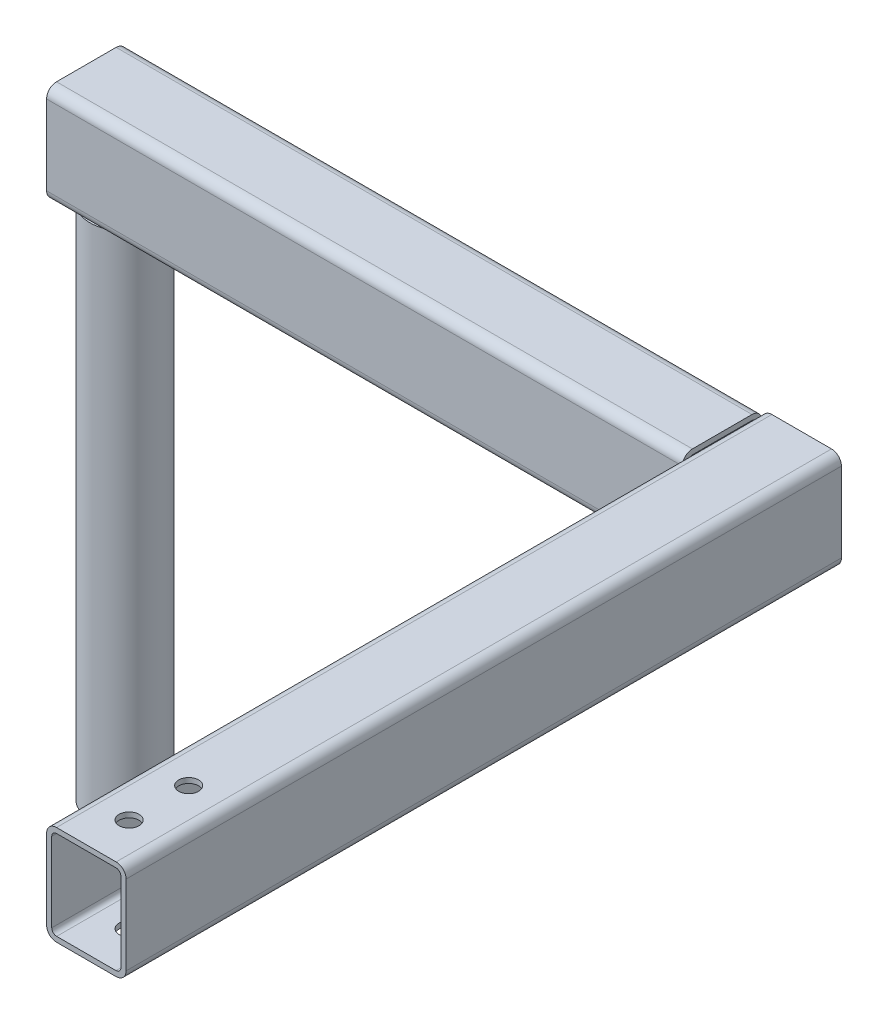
from build123d import *

# Parameters (mm, degrees)
SKETCH1_W           = 25.4
SKETCH1_H           = 31.75
SKETCH1_W_2         = 22.098
SKETCH1_H_2         = 28.448
EXTRUDE_THIN1_DEPTH = 228.6
FILLET1_R           = 1.5748
FILLET2_R           = 3.175
EXTRUDE_THIN2_START = -12.7
SKETCH2_W           = 25.4
SKETCH2_H           = 31.75
SKETCH2_W_2         = 22.098
SKETCH2_H_2         = 28.448
EXTRUDE_THIN2_DEPTH = 203.2
FILLET3_R           = 3.175
FILLET4_R           = 1.651
SKETCH3_R           = 11.1125
SKETCH3_R_2         = 9.4615
EXTRUDE_THIN3_DEPTH = 165.1
SKETCH4_R           = 3.175
CUT_EXTRUDE1_DEPTH  = 48.26


with BuildPart() as part:
    # Sketch1 → Extrude-Thin1 (new body)
    with BuildSketch(Plane.XY):
        Rectangle(SKETCH1_W, SKETCH1_H)
        Rectangle(SKETCH1_W_2, SKETCH1_H_2, mode=Mode.SUBTRACT)
    extrude(amount=EXTRUDE_THIN1_DEPTH)

    # Fillet1
    fillet1_edges = [part.edges().sort_by_distance(p)[0] for p in [
        (-11.049, 14.224, 114.3),
        (-11.049, -14.224, 114.3),
        (11.049, -14.224, 114.3),
        (11.049, 14.224, 114.3),
    ]]
    fillet(fillet1_edges, radius=FILLET1_R)

    # Fillet2
    fillet2_edges = [part.edges().sort_by_distance(p)[0] for p in [
        (-12.7, 15.875, 114.3),
        (12.7, 15.875, 114.3),
        (12.7, -15.875, 114.3),
        (-12.7, -15.875, 114.3),
    ]]
    fillet(fillet2_edges, radius=FILLET2_R)

    # Sketch4 → Cut-Extrude1 (cut)
    with BuildSketch(Plane(origin=(0, 15.875, 0), x_dir=(1, 0, 0), z_dir=(0, 1, 0))):
        with Locations(Location((0, -214.9348, 0), (0, 0, 180))):
            Circle(SKETCH4_R)
        with Locations(Location((0, -195.8848, 0), (0, 0, 180))):
            Circle(SKETCH4_R)
    extrude(amount=-CUT_EXTRUDE1_DEPTH, mode=Mode.SUBTRACT)


with BuildPart() as body_2:
    # Sketch2 → Extrude-Thin2 (new body)
    with BuildSketch(Plane(origin=(0, 0, 0), x_dir=(0, 0, -1), z_dir=(1, 0, 0)).offset(EXTRUDE_THIN2_START)):
        with Locations((-12.7, 0)):
            Rectangle(SKETCH2_W, SKETCH2_H)
        with Locations((-12.7, 0)):
            Rectangle(SKETCH2_W_2, SKETCH2_H_2, mode=Mode.SUBTRACT)
    extrude(amount=-EXTRUDE_THIN2_DEPTH)

    # Fillet3
    fillet3_edges = [body_2.edges().sort_by_distance(p)[0] for p in [
        (-114.3, -15.875, 0),
        (-114.3, -15.875, 25.4),
        (-114.3, 15.875, 25.4),
        (-114.3, 15.875, 0),
    ]]
    fillet(fillet3_edges, radius=FILLET3_R)

    # Fillet4
    fillet4_edges = [body_2.edges().sort_by_distance(p)[0] for p in [
        (-114.3, 14.224, 1.651),
        (-114.3, -14.224, 1.651),
        (-114.3, -14.224, 23.749),
        (-114.3, 14.224, 23.749),
    ]]
    fillet(fillet4_edges, radius=FILLET4_R)


with BuildPart() as body_3:
    # Sketch3 → Extrude-Thin3 (new body)
    with BuildSketch(Plane.XZ.offset(15.875)):
        with Locations((-203.2, 13.056547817)):
            Circle(SKETCH3_R)
        with Locations((-203.2, 13.056547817)):
            Circle(SKETCH3_R_2, mode=Mode.SUBTRACT)
    extrude(amount=EXTRUDE_THIN3_DEPTH)


solid = Compound([part.part, body_2.part, body_3.part])
